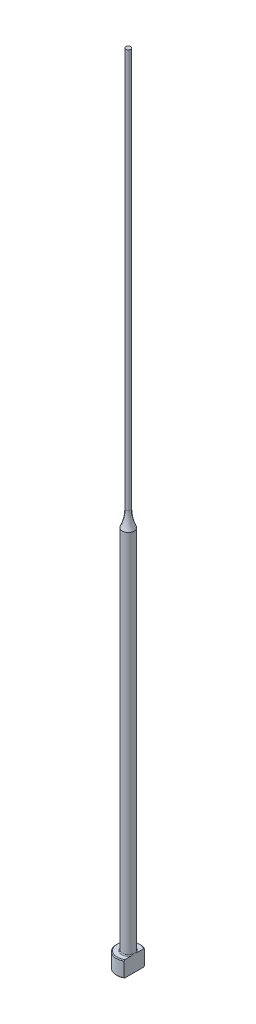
from build123d import *
from build123d.topology import SkipClean

# Parameters (mm, degrees)
CHAMFER1_SIZE    = 0.2
FILLET1_R        = 0.2
KEYED_HEAD_DEPTH = 201.044994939


with BuildPart() as part:
    # Sketch1 → Revolve1 (revolve)
    with BuildSketch(Plane.XY, mode=Mode.PRIVATE) as revolve1_sk:
        with BuildLine():
            Line((0, 0), (-3, 0))
            Line((-3, 0), (-3, 4))
            Line((-3, 4), (-1.5, 4))
            Line((-1.5, 4), (-1.5, 95.853917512))
            ThreePointArc((-1.5, 95.853917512), (-0.827589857, 97.878679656), (-0.6, 100))
            Line((-0.6, 100), (-0.6, 200))
            Line((-0.6, 200), (0, 200))
            Line((0, 200), (0, 0))
        make_face()
    revolve(revolve1_sk.sketch.rotate(Axis((0, 259.958771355, 0), (0, -1, 0)), 270), axis=Axis((0, 259.958771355, 0), (0, -1, 0)))

    # Chamfer1
    chamfer1_edges = [part.edges().sort_by_distance(p)[0] for p in [
        (0, 0, -3),
        (0, 4, -3),
    ]]
    chamfer(chamfer1_edges, length=CHAMFER1_SIZE)

    # Fillet1
    fillet1_edges = [part.edges().sort_by_distance(p)[0] for p in [
        (0, 4, -1.5),
    ]]
    fillet(fillet1_edges, radius=FILLET1_R)

    # Sketch2 → Keyed Head (cut, through all)
    with SkipClean():  # the faces are left unmerged after this step: merging them gives an invalid solid
        with BuildSketch(Plane(origin=(0, 0, 0), x_dir=(1, 0, 0), z_dir=(0, 1, 0))):
            with BuildLine():
                Line((1.5, -2.598076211), (1.5, 2.598076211))
                ThreePointArc((1.5, 2.598076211), (3, 0), (1.5, -2.598076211))
            make_face()
        extrude(amount=KEYED_HEAD_DEPTH, mode=Mode.SUBTRACT)


solid = part.part
